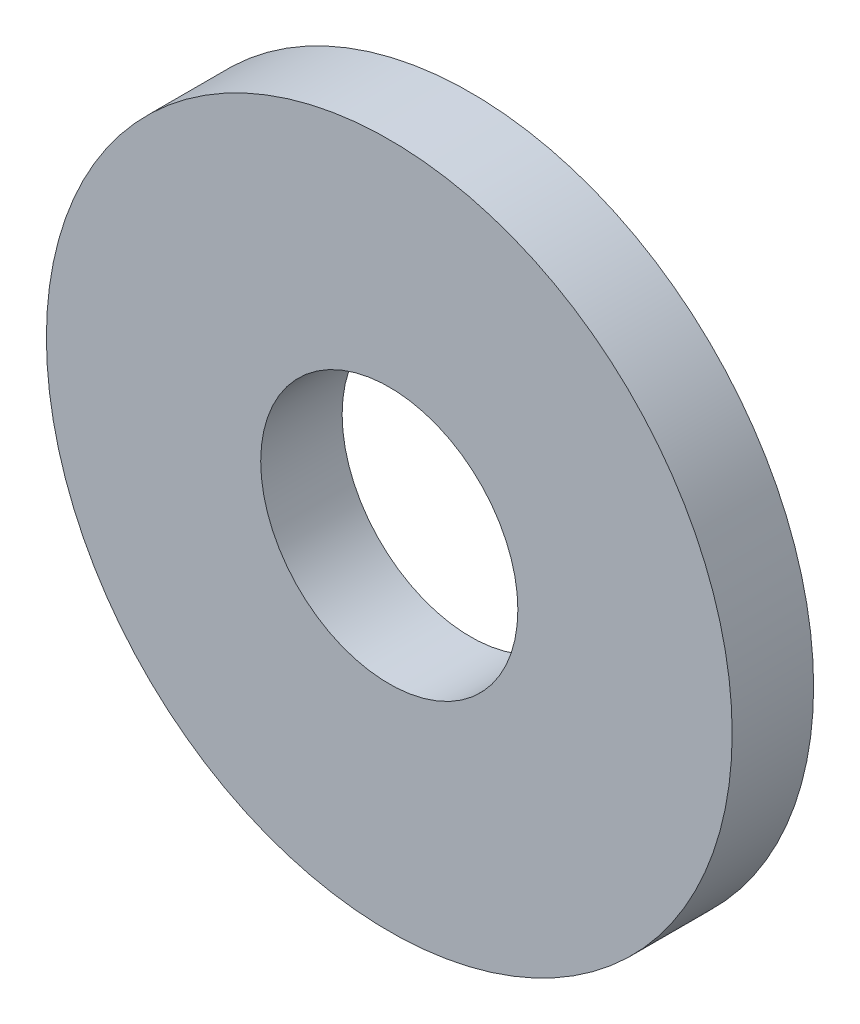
from build123d import *

# Parameters (mm, degrees)
ESQUISSE1_R   = 8
ESQUISSE1_R_2 = 3
BASE_DEPTH    = 1.9


with BuildPart() as part:
    # Esquisse1 → BASE (new body)
    with BuildSketch(Plane.XY):
        with Locations(Location((0, 0, 0), (0, 0, 180))):
            Circle(ESQUISSE1_R)
        with Locations(Location((0, 0, 0), (0, 0, 180))):
            Circle(ESQUISSE1_R_2, mode=Mode.SUBTRACT)
    extrude(amount=BASE_DEPTH)


solid = part.part
